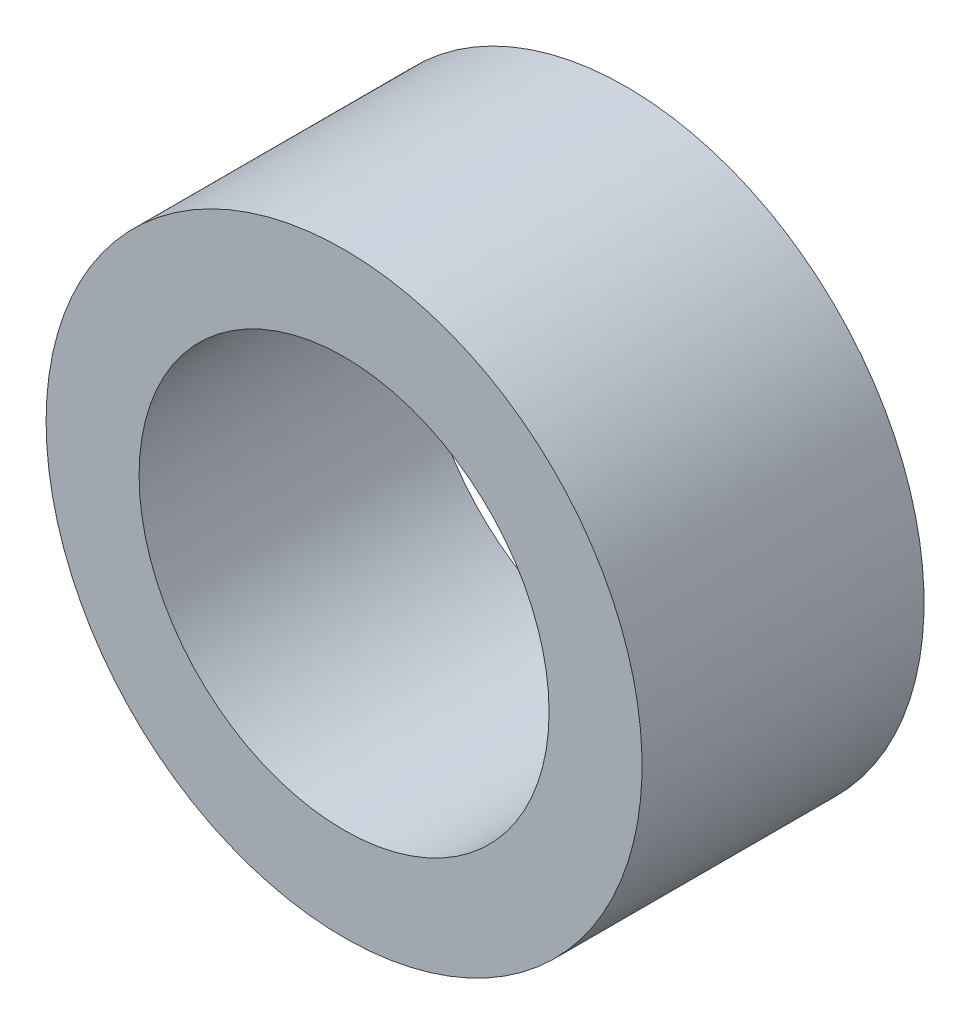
from build123d import *

# Parameters (mm, degrees)
SKETCH2_W = 82.940986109
SKETCH2_H = 251.590921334


with BuildPart() as part:
    # Sketch2 → Revolve1 (revolve)
    with BuildSketch(Plane(origin=(0, 0, 0), x_dir=(-1, 0, 0), z_dir=(0, 1, 0)), mode=Mode.PRIVATE) as revolve1_sk:
        with Locations((-224.347611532, 125.042444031)):
            Rectangle(SKETCH2_W, SKETCH2_H)
    revolve(revolve1_sk.sketch.rotate(Axis((0, 0, 0), (0, 0, 1)), 180), axis=Axis((0, 0, 0), (0, 0, 1)))


solid = part.part
